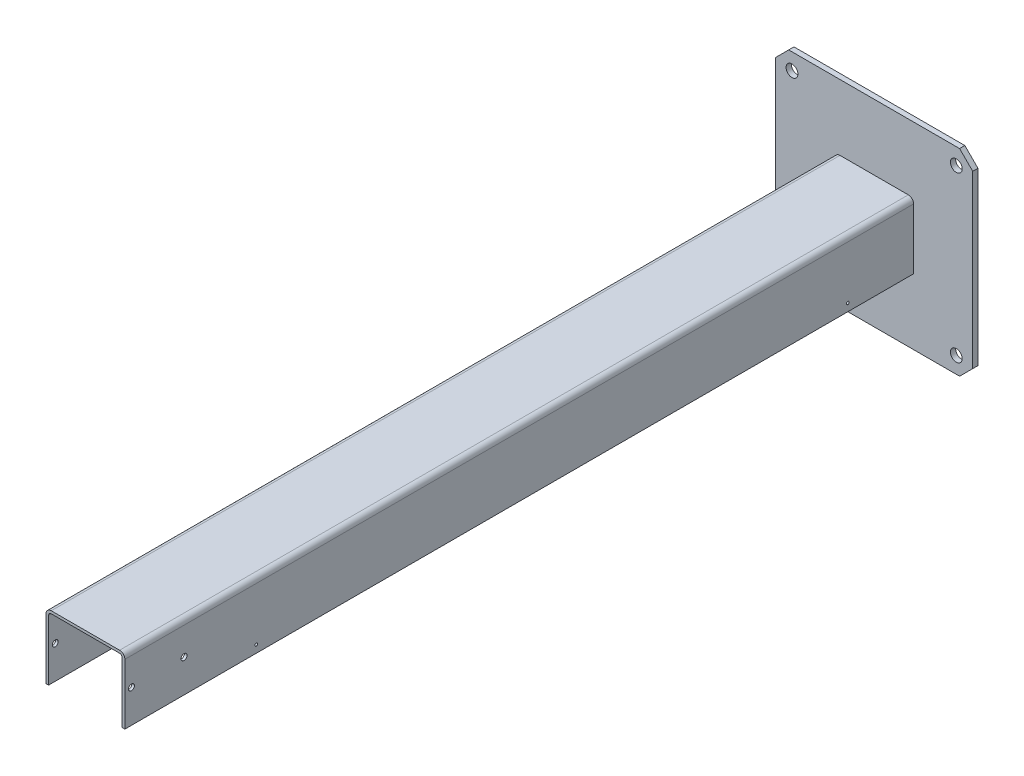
from build123d import *

# Parameters (mm, degrees)
ESQUISSE1_W             = 300
ESQUISSE1_H             = 300
BASE_EXTRUSION_DEPTH    = 8
BOSS_EXTRU_MINCE1_DEPTH = 1200
ESQUISSE5_R             = 9
ENL_V_MAT_EXTRU_2_DEPTH = 1219.605760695
CHANFREIN1_SIZE         = 20
TROU_TARAUD_M5X0_81_D   = 4.2
ESQUISSE8_R             = 4.5
ENL_V_MAT_EXTRU_3_DEPTH = 1236.258677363


with BuildPart() as part:
    # Esquisse1 → Base-Extrusion (new body)
    with BuildSketch(Plane.XY):
        Rectangle(ESQUISSE1_W, ESQUISSE1_H)
    extrude(amount=BASE_EXTRUSION_DEPTH)

    # Esquisse2 → Boss.-Extru.-Mince1 (add)
    with BuildSketch(Plane.XY.offset(8)):
        with BuildLine():
            Line((-60, -50), (-60, 42))
            ThreePointArc((-60, 42), (-57.656854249, 47.656854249), (-52, 50))
            Line((-52, 50), (52, 50))
            ThreePointArc((52, 50), (57.656854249, 47.656854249), (60, 42))
            Line((60, 42), (60, -50))
            Line((60, -50), (56, -50))
            Line((56, -50), (56, 42))
            ThreePointArc((56, 42), (54.828427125, 44.828427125), (52, 46))
            Line((52, 46), (-52, 46))
            ThreePointArc((-52, 46), (-54.828427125, 44.828427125), (-56, 42))
            Line((-56, 42), (-56, -50))
            Line((-56, -50), (-60, -50))
        make_face()
    extrude(amount=BOSS_EXTRU_MINCE1_DEPTH)

    # Esquisse5 → Enl_v. mat.-Extru.2 (cut, through all)
    with BuildSketch(Plane.XY.offset(8)):
        with Locations((125, 125)):
            Circle(ESQUISSE5_R)
        with Locations((125, -125)):
            Circle(ESQUISSE5_R)
        with Locations((-125, -125)):
            Circle(ESQUISSE5_R)
        with Locations((-125, 125)):
            Circle(ESQUISSE5_R)
    extrude(amount=-ENL_V_MAT_EXTRU_2_DEPTH, mode=Mode.SUBTRACT)

    # Chanfrein1
    chanfrein1_edges = [part.edges().sort_by_distance(p)[0] for p in [
        (-150, 150, 4),
        (150, 150, 4),
        (150, -150, 4),
        (-150, -150, 4),
    ]]
    chamfer(chanfrein1_edges, length=CHANFREIN1_SIZE)

    # Trou taraud_ M5x0.81 (through all)
    with Locations(Plane(origin=(60, 0, 0), x_dir=(0, 0, -1), z_dir=(1, 0, 0))):
        with Locations((-1008, -38.5), (-108, -38.5)):
            Hole(TROU_TARAUD_M5X0_81_D / 2)

    # Esquisse8 → Enl_v. mat.-Extru.3 (cut, through all)
    with BuildSketch(Plane.ZY.offset(60)):
        with Locations((1198, 0)):
            Circle(ESQUISSE8_R)
        with Locations((1118, 0)):
            Circle(ESQUISSE8_R)
    extrude(amount=-ENL_V_MAT_EXTRU_3_DEPTH, mode=Mode.SUBTRACT)


solid = part.part
